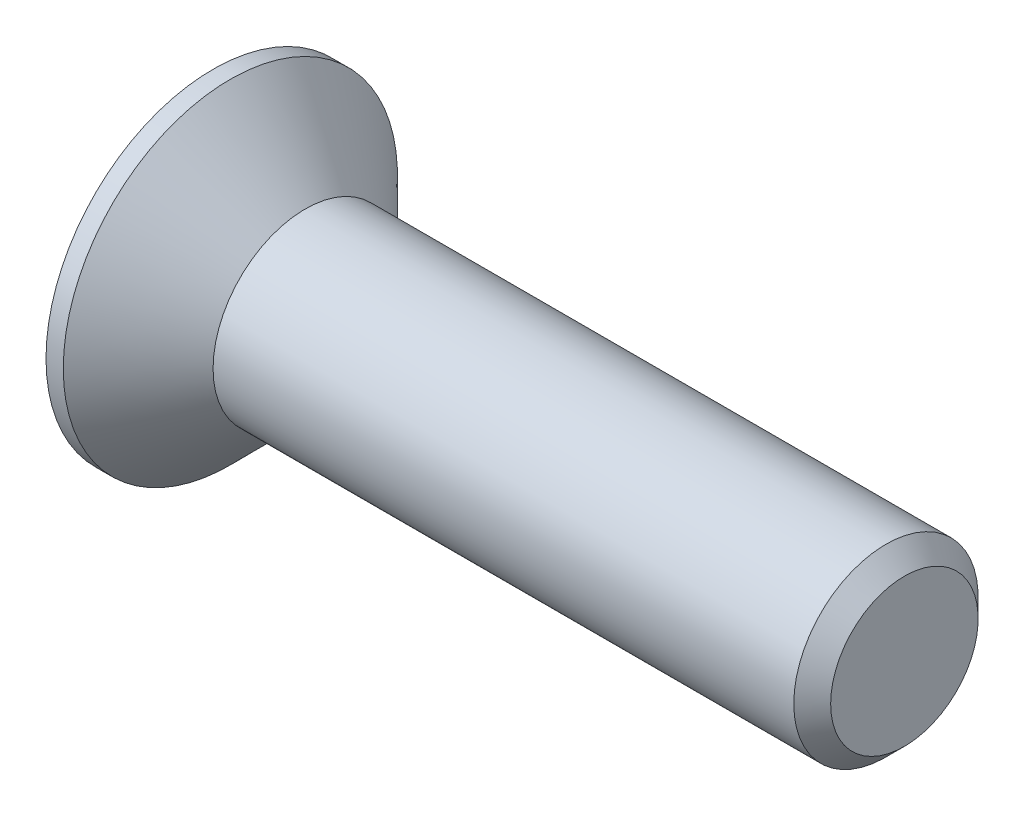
from build123d import *

# Parameters (mm, degrees)
CHAMFER1_SIZE      = 0.8
CUT_EXTRUDE1_DEPTH = 3.45


with BuildPart() as part:
    # Sketch1 → Revolve1 (revolve)
    with BuildSketch(Plane.XY, mode=Mode.PRIVATE) as revolve1_sk:
        Polygon((-4, 7.25), (-4, 0), (26, 0), (26, 4), (0, 4), (-3.25, 7.25), align=None)
    revolve(revolve1_sk.sketch.rotate(Axis((-4, 0, 0), (1, 0, 0)), 90), axis=Axis((-4, 0, 0), (1, 0, 0)))

    # Chamfer1
    chamfer1_edges = [part.edges().sort_by_distance(p)[0] for p in [
        (26, 0, -4),
    ]]
    chamfer(chamfer1_edges, length=CHAMFER1_SIZE)

    # Sketch2 → Cut-Extrude1 (cut)
    with BuildSketch(Plane.ZY.offset(4)):
        Polygon((-1.09, 4.35), (1.09, 4.35), (1.09, 1.09), (4.35, 1.09), (4.35, -1.09), (1.09, -1.09), (1.09, -4.35), (-1.09, -4.35), (-1.09, -1.09), (-4.35, -1.09), (-4.35, 1.09), (-1.09, 1.09), align=None)
    extrude(amount=-CUT_EXTRUDE1_DEPTH, mode=Mode.SUBTRACT)


solid = part.part
